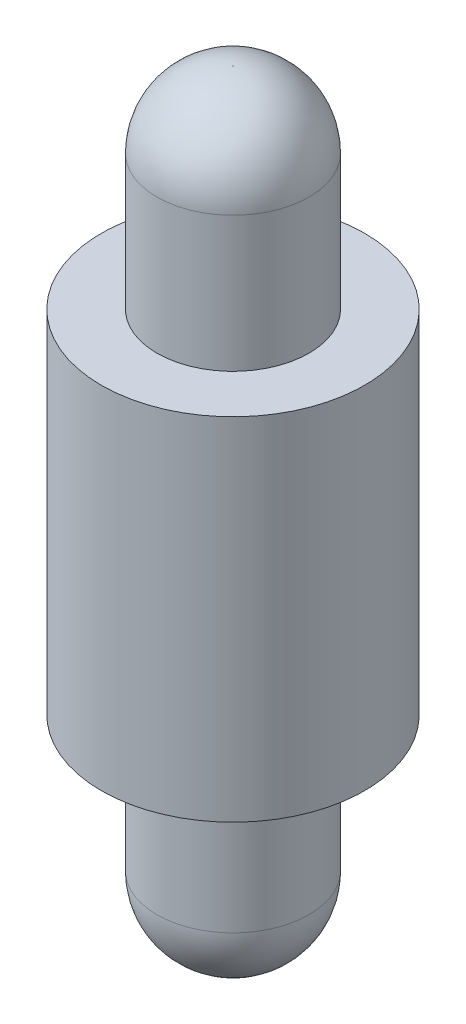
ISO-10303-21;
HEADER;
FILE_DESCRIPTION(('STEP AP214'),'2;1');
FILE_NAME('part.step','',(''),(''),'','','');
FILE_SCHEMA(('AUTOMOTIVE_DESIGN { 1 0 10303 214 1 1 1 1 }'));
ENDSEC;
DATA;
#1=APPLICATION_CONTEXT('core data for automotive mechanical design processes');
#2=APPLICATION_PROTOCOL_DEFINITION('international standard','automotive_design',2000,#1);
#3=PRODUCT_CONTEXT('',#1,'mechanical');
#4=PRODUCT('Part','Part','',(#3));
#5=PRODUCT_RELATED_PRODUCT_CATEGORY('part','',(#4));
#6=PRODUCT_DEFINITION_FORMATION('','',#4);
#7=PRODUCT_DEFINITION_CONTEXT('part definition',#1,'design');
#8=PRODUCT_DEFINITION('design','',#6,#7);
#9=PRODUCT_DEFINITION_SHAPE('','',#8);
#10=(LENGTH_UNIT() NAMED_UNIT(*) SI_UNIT(.MILLI.,.METRE.));
#11=(NAMED_UNIT(*) PLANE_ANGLE_UNIT() SI_UNIT($,.RADIAN.));
#12=(NAMED_UNIT(*) SI_UNIT($,.STERADIAN.) SOLID_ANGLE_UNIT());
#13=UNCERTAINTY_MEASURE_WITH_UNIT(LENGTH_MEASURE(1.E-05),#10,'distance_accuracy_value','');
#14=(GEOMETRIC_REPRESENTATION_CONTEXT(3) GLOBAL_UNCERTAINTY_ASSIGNED_CONTEXT((#13)) GLOBAL_UNIT_ASSIGNED_CONTEXT((#10,
#11,#12)) REPRESENTATION_CONTEXT('',''));
#15=CARTESIAN_POINT('',(0.,0.,0.));
#16=DIRECTION('',(0.,0.,1.));
#17=DIRECTION('',(1.,0.,0.));
#18=AXIS2_PLACEMENT_3D('',#15,#16,#17);
#19=CARTESIAN_POINT('',(0.,6.,0.));
#20=DIRECTION('',(0.,1.,0.));
#21=DIRECTION('',(0.,0.,1.));
#22=AXIS2_PLACEMENT_3D('',#19,#20,#21);
#23=PLANE('',#22);
#24=CARTESIAN_POINT('',(0.,6.,0.));
#25=DIRECTION('',(0.,1.,0.));
#26=DIRECTION('',(0.,0.,1.));
#27=AXIS2_PLACEMENT_3D('',#24,#25,#26);
#28=CIRCLE('',#27,2.25);
#29=CARTESIAN_POINT('',(0.,6.,2.25));
#30=VERTEX_POINT('',#29);
#31=EDGE_CURVE('E54',#30,#30,#28,.T.);
#32=ORIENTED_EDGE('',*,*,#31,.T.);
#33=EDGE_LOOP('',(#32));
#34=FACE_BOUND('',#33,.T.);
#35=CARTESIAN_POINT('',(0.,6.,0.));
#36=DIRECTION('',(0.,1.,0.));
#37=DIRECTION('',(0.,0.,1.));
#38=AXIS2_PLACEMENT_3D('',#35,#36,#37);
#39=CIRCLE('',#38,1.3);
#40=CARTESIAN_POINT('',(0.,6.,1.3));
#41=VERTEX_POINT('',#40);
#42=EDGE_CURVE('E60',#41,#41,#39,.T.);
#43=ORIENTED_EDGE('',*,*,#42,.F.);
#44=EDGE_LOOP('',(#43));
#45=FACE_BOUND('',#44,.T.);
#46=ADVANCED_FACE('F31',(#34,#45),#23,.T.);
#47=CARTESIAN_POINT('',(0.,0.,0.));
#48=DIRECTION('',(0.,1.,0.));
#49=DIRECTION('',(0.,0.,1.));
#50=AXIS2_PLACEMENT_3D('',#47,#48,#49);
#51=PLANE('',#50);
#52=CARTESIAN_POINT('',(0.,0.,0.));
#53=DIRECTION('',(0.,1.,0.));
#54=DIRECTION('',(0.,0.,1.));
#55=AXIS2_PLACEMENT_3D('',#52,#53,#54);
#56=CIRCLE('',#55,2.25);
#57=CARTESIAN_POINT('',(0.,0.,2.25));
#58=VERTEX_POINT('',#57);
#59=EDGE_CURVE('E57',#58,#58,#56,.T.);
#60=ORIENTED_EDGE('',*,*,#59,.F.);
#61=EDGE_LOOP('',(#60));
#62=FACE_BOUND('',#61,.T.);
#63=CARTESIAN_POINT('',(0.,0.,0.));
#64=DIRECTION('',(0.,1.,0.));
#65=DIRECTION('',(0.,0.,1.));
#66=AXIS2_PLACEMENT_3D('',#63,#64,#65);
#67=CIRCLE('',#66,1.3);
#68=CARTESIAN_POINT('',(0.,0.,1.3));
#69=VERTEX_POINT('',#68);
#70=EDGE_CURVE('E51',#69,#69,#67,.F.);
#71=ORIENTED_EDGE('',*,*,#70,.F.);
#72=EDGE_LOOP('',(#71));
#73=FACE_BOUND('',#72,.T.);
#74=ADVANCED_FACE('F67',(#62,#73),#51,.F.);
#75=CARTESIAN_POINT('',(0.,6.,0.));
#76=DIRECTION('',(0.,-1.,0.));
#77=DIRECTION('',(0.,0.,-1.));
#78=AXIS2_PLACEMENT_3D('',#75,#76,#77);
#79=CYLINDRICAL_SURFACE('',#78,2.25);
#80=ORIENTED_EDGE('',*,*,#31,.F.);
#81=EDGE_LOOP('',(#80));
#82=FACE_BOUND('',#81,.T.);
#83=ORIENTED_EDGE('',*,*,#59,.T.);
#84=EDGE_LOOP('',(#83));
#85=FACE_BOUND('',#84,.T.);
#86=ADVANCED_FACE('F33',(#82,#85),#79,.T.);
#87=CARTESIAN_POINT('',(0.,-3.6,0.));
#88=DIRECTION('',(0.,1.,0.));
#89=DIRECTION('',(0.,0.,1.));
#90=AXIS2_PLACEMENT_3D('',#87,#88,#89);
#91=CYLINDRICAL_SURFACE('',#90,1.3);
#92=CARTESIAN_POINT('',(0.,-2.31,0.));
#93=DIRECTION('',(0.,-1.,0.));
#94=DIRECTION('',(0.,0.,-1.));
#95=AXIS2_PLACEMENT_3D('',#92,#93,#94);
#96=CIRCLE('',#95,1.3);
#97=CARTESIAN_POINT('',(0.,-2.31,-1.3));
#98=VERTEX_POINT('',#97);
#99=EDGE_CURVE('E42',#98,#98,#96,.F.);
#100=ORIENTED_EDGE('',*,*,#99,.T.);
#101=EDGE_LOOP('',(#100));
#102=FACE_BOUND('',#101,.T.);
#103=ORIENTED_EDGE('',*,*,#70,.T.);
#104=EDGE_LOOP('',(#103));
#105=FACE_BOUND('',#104,.T.);
#106=ADVANCED_FACE('F75',(#102,#105),#91,.T.);
#107=CARTESIAN_POINT('',(0.,-3.6,0.));
#108=DIRECTION('',(0.,-1.,0.));
#109=DIRECTION('',(0.,0.,-1.));
#110=AXIS2_PLACEMENT_3D('',#107,#108,#109);
#111=PLANE('',#110);
#112=CARTESIAN_POINT('',(0.,-3.6,0.));
#113=DIRECTION('',(0.,-1.,0.));
#114=DIRECTION('',(0.,0.,-1.));
#115=AXIS2_PLACEMENT_3D('',#112,#113,#114);
#116=CIRCLE('',#115,0.00999999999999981);
#117=CARTESIAN_POINT('',(0.,-3.6,-0.00999999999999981));
#118=VERTEX_POINT('',#117);
#119=EDGE_CURVE('E46',#118,#118,#116,.T.);
#120=ORIENTED_EDGE('',*,*,#119,.T.);
#121=EDGE_LOOP('',(#120));
#122=FACE_BOUND('',#121,.T.);
#123=ADVANCED_FACE('F78',(#122),#111,.T.);
#124=CARTESIAN_POINT('',(0.,9.6,0.));
#125=DIRECTION('',(0.,-1.,0.));
#126=DIRECTION('',(0.,0.,-1.));
#127=AXIS2_PLACEMENT_3D('',#124,#125,#126);
#128=CYLINDRICAL_SURFACE('',#127,1.3);
#129=CARTESIAN_POINT('',(0.,8.31,0.));
#130=DIRECTION('',(0.,1.,0.));
#131=DIRECTION('',(0.,0.,1.));
#132=AXIS2_PLACEMENT_3D('',#129,#130,#131);
#133=CIRCLE('',#132,1.3);
#134=CARTESIAN_POINT('',(0.,8.31,1.3));
#135=VERTEX_POINT('',#134);
#136=EDGE_CURVE('E10',#135,#135,#133,.F.);
#137=ORIENTED_EDGE('',*,*,#136,.T.);
#138=EDGE_LOOP('',(#137));
#139=FACE_BOUND('',#138,.T.);
#140=ORIENTED_EDGE('',*,*,#42,.T.);
#141=EDGE_LOOP('',(#140));
#142=FACE_BOUND('',#141,.T.);
#143=ADVANCED_FACE('F64',(#139,#142),#128,.T.);
#144=CARTESIAN_POINT('',(0.,9.6,0.));
#145=DIRECTION('',(0.,1.,0.));
#146=DIRECTION('',(0.,0.,1.));
#147=AXIS2_PLACEMENT_3D('',#144,#145,#146);
#148=PLANE('',#147);
#149=CARTESIAN_POINT('',(0.,9.6,0.));
#150=DIRECTION('',(0.,1.,0.));
#151=DIRECTION('',(0.,0.,1.));
#152=AXIS2_PLACEMENT_3D('',#149,#150,#151);
#153=CIRCLE('',#152,0.00999999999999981);
#154=CARTESIAN_POINT('',(0.,9.6,0.00999999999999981));
#155=VERTEX_POINT('',#154);
#156=EDGE_CURVE('E38',#155,#155,#153,.T.);
#157=ORIENTED_EDGE('',*,*,#156,.T.);
#158=EDGE_LOOP('',(#157));
#159=FACE_BOUND('',#158,.T.);
#160=ADVANCED_FACE('F85',(#159),#148,.T.);
#161=CARTESIAN_POINT('',(0.,-2.31,0.));
#162=DIRECTION('',(0.,-1.,0.));
#163=DIRECTION('',(0.,0.,-1.));
#164=AXIS2_PLACEMENT_3D('',#161,#162,#163);
#165=DEGENERATE_TOROIDAL_SURFACE('',#164,0.00999999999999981,1.29,.T.);
#166=ORIENTED_EDGE('',*,*,#99,.F.);
#167=EDGE_LOOP('',(#166));
#168=FACE_BOUND('',#167,.T.);
#169=ORIENTED_EDGE('',*,*,#119,.F.);
#170=EDGE_LOOP('',(#169));
#171=FACE_BOUND('',#170,.T.);
#172=ADVANCED_FACE('F88',(#168,#171),#165,.T.);
#173=CARTESIAN_POINT('',(0.,8.31,0.));
#174=DIRECTION('',(0.,1.,0.));
#175=DIRECTION('',(0.,0.,1.));
#176=AXIS2_PLACEMENT_3D('',#173,#174,#175);
#177=DEGENERATE_TOROIDAL_SURFACE('',#176,0.00999999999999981,1.29,.T.);
#178=ORIENTED_EDGE('',*,*,#136,.F.);
#179=EDGE_LOOP('',(#178));
#180=FACE_BOUND('',#179,.T.);
#181=ORIENTED_EDGE('',*,*,#156,.F.);
#182=EDGE_LOOP('',(#181));
#183=FACE_BOUND('',#182,.T.);
#184=ADVANCED_FACE('F91',(#180,#183),#177,.T.);
#185=CLOSED_SHELL('',(#46,#74,#86,#106,#123,#143,#160,#172,#184));
#186=MANIFOLD_SOLID_BREP('B2',#185);
#187=ADVANCED_BREP_SHAPE_REPRESENTATION('',(#18,#186),#14);
#188=SHAPE_DEFINITION_REPRESENTATION(#9,#187);
ENDSEC;
END-ISO-10303-21;
